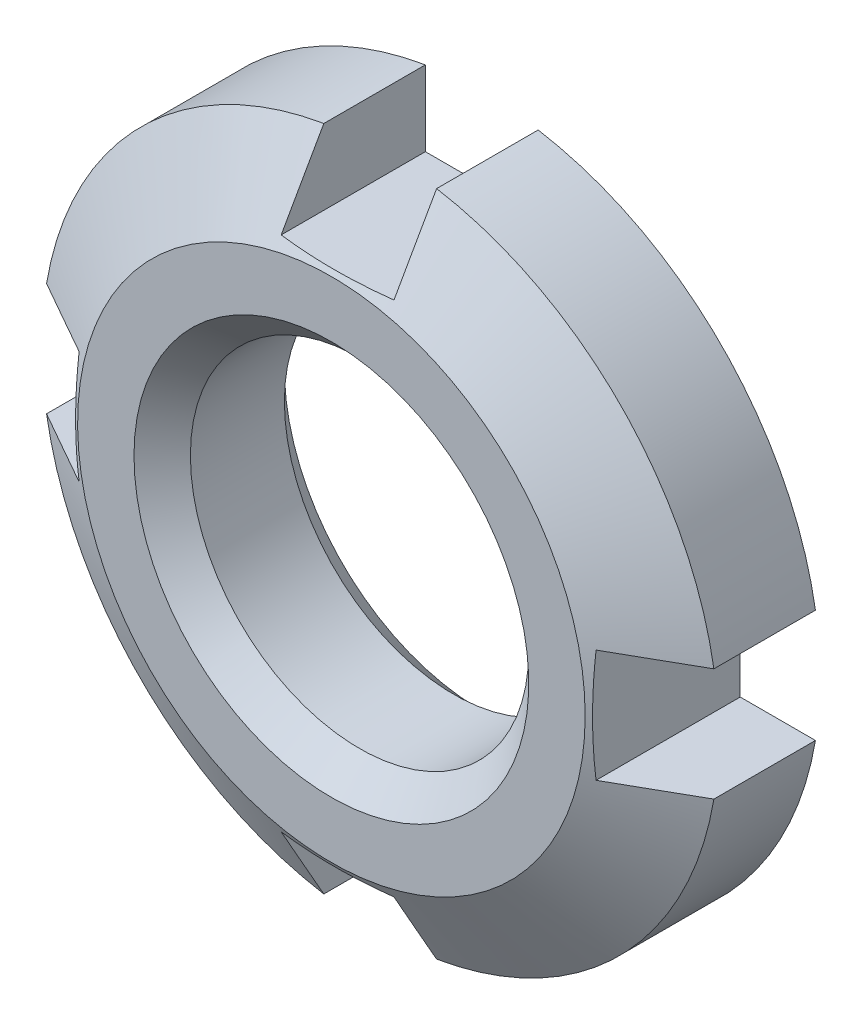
from build123d import *

# Parameters (mm, degrees)
SLOTSKE_W        = 3
SLOTSKE_H        = 3
CUTSLOT_DEPTH    = 14.341664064
SLOTPAT_COUNT    = 4
HOLESKE_R        = 4.5
TAPPEDHOLE_DEPTH = 14.171939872
CHAMFER1_SIZE    = 0.75


with BuildPart() as part:
    # BaseNutSke → BaseNut (revolve)
    with BuildSketch(Plane(origin=(0, 0, 0), x_dir=(1, 0, 0), z_dir=(0, 1, 0)), mode=Mode.PRIVATE) as basenut_sk:
        Polygon((-6.75, -4), (0, -4), (0, 0), (-9, 0), (-9, -2.700961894), align=None)
    revolve(basenut_sk.sketch.rotate(Axis((0, 0, 0), (0, 0, -1)), 180), axis=Axis((0, 0, 0), (0, 0, -1)))

    # SlotSke → CutSlot (cut, through all)
    with BuildSketch(Plane.XY):
        with Locations((0, 8.374119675)):
            Rectangle(SLOTSKE_W, SLOTSKE_H)
    cutslot = extrude(amount=CUTSLOT_DEPTH, mode=Mode.SUBTRACT)

    # SlotPat: CutSlot ×4 about axis
    slotpat_axis = Axis((0, 0, 0), (0, 0, 1))
    for i in range(1, SLOTPAT_COUNT):
        add(cutslot.rotate(slotpat_axis, i * 360 / SLOTPAT_COUNT), mode=Mode.SUBTRACT)

    # HoleSke → TappedHole (cut, through all)
    with BuildSketch(Plane.XY):
        Circle(HOLESKE_R)
    extrude(amount=TAPPEDHOLE_DEPTH, mode=Mode.SUBTRACT)

    # Chamfer1
    chamfer1_edges = [part.edges().sort_by_distance(p)[0] for p in [
        (-4.5, 0, 0),
        (-4.5, 0, 4),
    ]]
    chamfer(chamfer1_edges, length=CHAMFER1_SIZE)


solid = part.part
